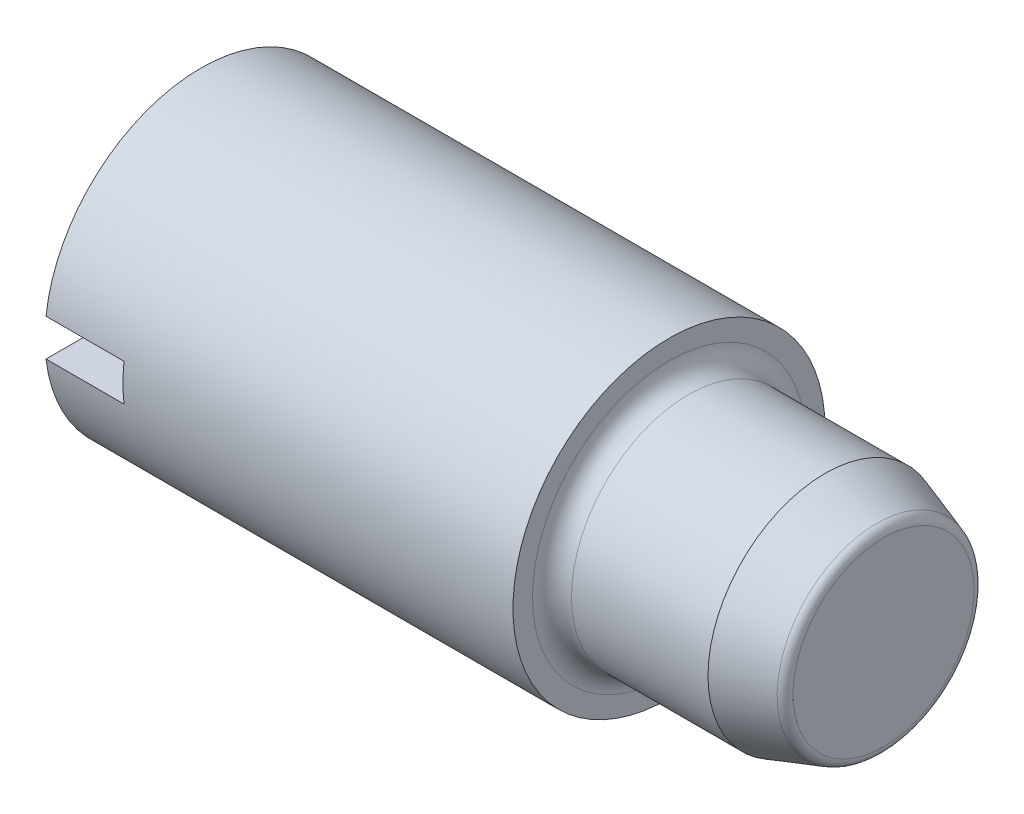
ISO-10303-21;
HEADER;
FILE_DESCRIPTION(('STEP AP214'),'2;1');
FILE_NAME('part.step','',(''),(''),'','','');
FILE_SCHEMA(('AUTOMOTIVE_DESIGN { 1 0 10303 214 1 1 1 1 }'));
ENDSEC;
DATA;
#1=APPLICATION_CONTEXT('core data for automotive mechanical design processes');
#2=APPLICATION_PROTOCOL_DEFINITION('international standard','automotive_design',2000,#1);
#3=PRODUCT_CONTEXT('',#1,'mechanical');
#4=PRODUCT('Part','Part','',(#3));
#5=PRODUCT_RELATED_PRODUCT_CATEGORY('part','',(#4));
#6=PRODUCT_DEFINITION_FORMATION('','',#4);
#7=PRODUCT_DEFINITION_CONTEXT('part definition',#1,'design');
#8=PRODUCT_DEFINITION('design','',#6,#7);
#9=PRODUCT_DEFINITION_SHAPE('','',#8);
#10=(LENGTH_UNIT() NAMED_UNIT(*) SI_UNIT(.MILLI.,.METRE.));
#11=(NAMED_UNIT(*) PLANE_ANGLE_UNIT() SI_UNIT($,.RADIAN.));
#12=(NAMED_UNIT(*) SI_UNIT($,.STERADIAN.) SOLID_ANGLE_UNIT());
#13=UNCERTAINTY_MEASURE_WITH_UNIT(LENGTH_MEASURE(1.E-05),#10,'distance_accuracy_value','');
#14=(GEOMETRIC_REPRESENTATION_CONTEXT(3) GLOBAL_UNCERTAINTY_ASSIGNED_CONTEXT((#13)) GLOBAL_UNIT_ASSIGNED_CONTEXT((#10,
#11,#12)) REPRESENTATION_CONTEXT('',''));
#15=CARTESIAN_POINT('',(0.,0.,0.));
#16=DIRECTION('',(0.,0.,1.));
#17=DIRECTION('',(1.,0.,0.));
#18=AXIS2_PLACEMENT_3D('',#15,#16,#17);
#19=CARTESIAN_POINT('',(29.7338498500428,3.,0.));
#20=DIRECTION('',(1.,0.,0.));
#21=DIRECTION('',(0.,0.,-1.));
#22=AXIS2_PLACEMENT_3D('',#19,#20,#21);
#23=PLANE('',#22);
#24=CARTESIAN_POINT('',(29.7338498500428,0.,0.));
#25=DIRECTION('',(-1.,0.,0.));
#26=DIRECTION('',(0.,1.,0.));
#27=AXIS2_PLACEMENT_3D('',#24,#25,#26);
#28=CIRCLE('',#27,4.63962038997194);
#29=CARTESIAN_POINT('',(29.7338498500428,4.63962038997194,0.));
#30=VERTEX_POINT('',#29);
#31=EDGE_CURVE('E88',#30,#30,#28,.T.);
#32=ORIENTED_EDGE('',*,*,#31,.F.);
#33=EDGE_LOOP('',(#32));
#34=FACE_BOUND('',#33,.T.);
#35=ADVANCED_FACE('F16',(#34),#23,.T.);
#36=CARTESIAN_POINT('',(29.2338498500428,0.,0.));
#37=DIRECTION('',(-1.,0.,0.));
#38=DIRECTION('',(0.,0.,1.));
#39=AXIS2_PLACEMENT_3D('',#36,#37,#38);
#40=TOROIDAL_SURFACE('',#39,4.63962038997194,0.5);
#41=CARTESIAN_POINT('',(29.3919637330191,0.,0.));
#42=DIRECTION('',(-1.,0.,0.));
#43=DIRECTION('',(0.,-1.,0.));
#44=AXIS2_PLACEMENT_3D('',#41,#42,#43);
#45=CIRCLE('',#44,5.11396203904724);
#46=CARTESIAN_POINT('',(29.3919637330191,-5.11396203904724,0.));
#47=VERTEX_POINT('',#46);
#48=EDGE_CURVE('E114',#47,#47,#45,.T.);
#49=ORIENTED_EDGE('',*,*,#48,.F.);
#50=EDGE_LOOP('',(#49));
#51=FACE_BOUND('',#50,.T.);
#52=ORIENTED_EDGE('',*,*,#31,.T.);
#53=EDGE_LOOP('',(#52));
#54=FACE_BOUND('',#53,.T.);
#55=ADVANCED_FACE('F93',(#51,#54),#40,.T.);
#56=CARTESIAN_POINT('',(26.733849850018,0.,0.));
#57=DIRECTION('',(-1.,0.,0.));
#58=DIRECTION('',(0.,0.,1.));
#59=AXIS2_PLACEMENT_3D('',#56,#57,#58);
#60=CONICAL_SURFACE('',#59,6.00000000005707,0.32175055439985);
#61=ORIENTED_EDGE('',*,*,#48,.T.);
#62=EDGE_LOOP('',(#61));
#63=FACE_BOUND('',#62,.T.);
#64=CARTESIAN_POINT('',(26.7338498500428,0.,0.));
#65=DIRECTION('',(1.,0.,0.));
#66=DIRECTION('',(0.,0.,-1.));
#67=AXIS2_PLACEMENT_3D('',#64,#65,#66);
#68=CIRCLE('',#67,6.);
#69=CARTESIAN_POINT('',(26.7338498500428,0.,-6.));
#70=VERTEX_POINT('',#69);
#71=EDGE_CURVE('E117',#70,#70,#68,.F.);
#72=ORIENTED_EDGE('',*,*,#71,.F.);
#73=EDGE_LOOP('',(#72));
#74=FACE_BOUND('',#73,.T.);
#75=ADVANCED_FACE('F104',(#63,#74),#60,.T.);
#76=CARTESIAN_POINT('',(24.2338498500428,0.,0.));
#77=DIRECTION('',(1.,0.,0.));
#78=DIRECTION('',(0.,0.,-1.));
#79=AXIS2_PLACEMENT_3D('',#76,#77,#78);
#80=CYLINDRICAL_SURFACE('',#79,6.);
#81=CARTESIAN_POINT('',(19.7338498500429,0.,0.));
#82=DIRECTION('',(1.,0.,0.));
#83=DIRECTION('',(0.,0.,-1.));
#84=AXIS2_PLACEMENT_3D('',#81,#82,#83);
#85=CIRCLE('',#84,6.);
#86=CARTESIAN_POINT('',(19.7338498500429,0.,-6.));
#87=VERTEX_POINT('',#86);
#88=EDGE_CURVE('E120',#87,#87,#85,.F.);
#89=ORIENTED_EDGE('',*,*,#88,.F.);
#90=EDGE_LOOP('',(#89));
#91=FACE_BOUND('',#90,.T.);
#92=ORIENTED_EDGE('',*,*,#71,.T.);
#93=EDGE_LOOP('',(#92));
#94=FACE_BOUND('',#93,.T.);
#95=ADVANCED_FACE('F129',(#91,#94),#80,.T.);
#96=CARTESIAN_POINT('',(19.7338498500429,0.,0.));
#97=DIRECTION('',(1.,0.,0.));
#98=DIRECTION('',(0.,0.,-1.));
#99=AXIS2_PLACEMENT_3D('',#96,#97,#98);
#100=TOROIDAL_SURFACE('',#99,7.,1.);
#101=ORIENTED_EDGE('',*,*,#88,.T.);
#102=EDGE_LOOP('',(#101));
#103=FACE_BOUND('',#102,.T.);
#104=CARTESIAN_POINT('',(18.7338498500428,0.,0.));
#105=DIRECTION('',(1.,0.,0.));
#106=DIRECTION('',(0.,1.,0.));
#107=AXIS2_PLACEMENT_3D('',#104,#105,#106);
#108=CIRCLE('',#107,7.);
#109=CARTESIAN_POINT('',(18.7338498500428,7.,0.));
#110=VERTEX_POINT('',#109);
#111=EDGE_CURVE('E75',#110,#110,#108,.F.);
#112=ORIENTED_EDGE('',*,*,#111,.F.);
#113=EDGE_LOOP('',(#112));
#114=FACE_BOUND('',#113,.T.);
#115=ADVANCED_FACE('F124',(#103,#114),#100,.F.);
#116=CARTESIAN_POINT('',(-5.26615014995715,4.,0.));
#117=DIRECTION('',(-1.,0.,0.));
#118=DIRECTION('',(0.,0.,1.));
#119=AXIS2_PLACEMENT_3D('',#116,#117,#118);
#120=PLANE('',#119);
#121=CARTESIAN_POINT('',(-5.26615014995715,0.,0.));
#122=DIRECTION('',(1.,0.,0.));
#123=DIRECTION('',(0.,0.,-1.));
#124=AXIS2_PLACEMENT_3D('',#121,#122,#123);
#125=CIRCLE('',#124,8.);
#126=CARTESIAN_POINT('',(-5.26615014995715,0.949999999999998,-7.9433934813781));
#127=VERTEX_POINT('',#126);
#128=CARTESIAN_POINT('',(-5.26615014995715,0.949999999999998,7.9433934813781));
#129=VERTEX_POINT('',#128);
#130=EDGE_CURVE('E147',#127,#129,#125,.T.);
#131=ORIENTED_EDGE('',*,*,#130,.F.);
#132=DIRECTION('',(0.,0.,1.));
#133=VECTOR('',#132,1.);
#134=CARTESIAN_POINT('',(-5.26615014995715,0.949999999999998,9.));
#135=LINE('',#134,#133);
#136=EDGE_CURVE('E67',#127,#129,#135,.T.);
#137=ORIENTED_EDGE('',*,*,#136,.T.);
#138=EDGE_LOOP('',(#131,#137));
#139=FACE_BOUND('',#138,.T.);
#140=ADVANCED_FACE('F128',(#139),#120,.T.);
#141=CARTESIAN_POINT('',(-5.26615014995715,0.949999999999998,9.));
#142=DIRECTION('',(0.,1.,0.));
#143=DIRECTION('',(0.,0.,1.));
#144=AXIS2_PLACEMENT_3D('',#141,#142,#143);
#145=PLANE('',#144);
#146=ORIENTED_EDGE('',*,*,#136,.F.);
#147=DIRECTION('',(1.,0.,0.));
#148=VECTOR('',#147,1.);
#149=CARTESIAN_POINT('',(6.73384985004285,0.949999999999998,-7.9433934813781));
#150=LINE('',#149,#148);
#151=CARTESIAN_POINT('',(-1.26615014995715,0.949999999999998,-7.9433934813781));
#152=VERTEX_POINT('',#151);
#153=EDGE_CURVE('E71',#152,#127,#150,.F.);
#154=ORIENTED_EDGE('',*,*,#153,.F.);
#155=DIRECTION('',(0.,0.,-1.));
#156=VECTOR('',#155,1.);
#157=CARTESIAN_POINT('',(-1.26615014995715,0.949999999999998,0.));
#158=LINE('',#157,#156);
#159=CARTESIAN_POINT('',(-1.26615014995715,0.949999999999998,7.9433934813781));
#160=VERTEX_POINT('',#159);
#161=EDGE_CURVE('E56',#152,#160,#158,.F.);
#162=ORIENTED_EDGE('',*,*,#161,.T.);
#163=DIRECTION('',(1.,0.,0.));
#164=VECTOR('',#163,1.);
#165=CARTESIAN_POINT('',(6.73384985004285,0.949999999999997,7.9433934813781));
#166=LINE('',#165,#164);
#167=EDGE_CURVE('E145',#129,#160,#166,.T.);
#168=ORIENTED_EDGE('',*,*,#167,.F.);
#169=EDGE_LOOP('',(#146,#154,#162,#168));
#170=FACE_BOUND('',#169,.T.);
#171=ADVANCED_FACE('F72',(#170),#145,.F.);
#172=CARTESIAN_POINT('',(-1.26615014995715,0.,0.));
#173=DIRECTION('',(1.,0.,0.));
#174=DIRECTION('',(0.,0.,-1.));
#175=AXIS2_PLACEMENT_3D('',#172,#173,#174);
#176=PLANE('',#175);
#177=ORIENTED_EDGE('',*,*,#161,.F.);
#178=CARTESIAN_POINT('',(-1.26615014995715,0.,0.));
#179=DIRECTION('',(1.,0.,0.));
#180=DIRECTION('',(0.,0.,-1.));
#181=AXIS2_PLACEMENT_3D('',#178,#179,#180);
#182=CIRCLE('',#181,8.);
#183=CARTESIAN_POINT('',(-1.26615014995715,-0.950000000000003,-7.9433934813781));
#184=VERTEX_POINT('',#183);
#185=EDGE_CURVE('E20',#184,#152,#182,.T.);
#186=ORIENTED_EDGE('',*,*,#185,.F.);
#187=DIRECTION('',(0.,0.,-1.));
#188=VECTOR('',#187,1.);
#189=CARTESIAN_POINT('',(-1.26615014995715,-0.950000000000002,-9.));
#190=LINE('',#189,#188);
#191=CARTESIAN_POINT('',(-1.26615014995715,-0.949999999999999,7.9433934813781));
#192=VERTEX_POINT('',#191);
#193=EDGE_CURVE('E66',#184,#192,#190,.F.);
#194=ORIENTED_EDGE('',*,*,#193,.T.);
#195=CARTESIAN_POINT('',(-1.26615014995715,0.,0.));
#196=DIRECTION('',(1.,0.,0.));
#197=DIRECTION('',(0.,0.,-1.));
#198=AXIS2_PLACEMENT_3D('',#195,#196,#197);
#199=CIRCLE('',#198,8.);
#200=EDGE_CURVE('E62',#160,#192,#199,.T.);
#201=ORIENTED_EDGE('',*,*,#200,.F.);
#202=EDGE_LOOP('',(#177,#186,#194,#201));
#203=FACE_BOUND('',#202,.T.);
#204=ADVANCED_FACE('F58',(#203),#176,.F.);
#205=CARTESIAN_POINT('',(-5.26615014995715,-0.950000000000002,-9.));
#206=DIRECTION('',(0.,-1.,0.));
#207=DIRECTION('',(0.,0.,-1.));
#208=AXIS2_PLACEMENT_3D('',#205,#206,#207);
#209=PLANE('',#208);
#210=ORIENTED_EDGE('',*,*,#193,.F.);
#211=DIRECTION('',(1.,0.,0.));
#212=VECTOR('',#211,1.);
#213=CARTESIAN_POINT('',(6.73384985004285,-0.950000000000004,-7.9433934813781));
#214=LINE('',#213,#212);
#215=CARTESIAN_POINT('',(-5.26615014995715,-0.950000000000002,-7.9433934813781));
#216=VERTEX_POINT('',#215);
#217=EDGE_CURVE('E79',#216,#184,#214,.T.);
#218=ORIENTED_EDGE('',*,*,#217,.F.);
#219=DIRECTION('',(0.,0.,1.));
#220=VECTOR('',#219,1.);
#221=CARTESIAN_POINT('',(-5.26615014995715,-0.95,0.));
#222=LINE('',#221,#220);
#223=CARTESIAN_POINT('',(-5.26615014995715,-0.95,7.9433934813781));
#224=VERTEX_POINT('',#223);
#225=EDGE_CURVE('E35',#224,#216,#222,.F.);
#226=ORIENTED_EDGE('',*,*,#225,.F.);
#227=DIRECTION('',(1.,0.,0.));
#228=VECTOR('',#227,1.);
#229=CARTESIAN_POINT('',(6.73384985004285,-0.949999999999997,7.9433934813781));
#230=LINE('',#229,#228);
#231=EDGE_CURVE('E149',#192,#224,#230,.F.);
#232=ORIENTED_EDGE('',*,*,#231,.F.);
#233=EDGE_LOOP('',(#210,#218,#226,#232));
#234=FACE_BOUND('',#233,.T.);
#235=ADVANCED_FACE('F168',(#234),#209,.F.);
#236=CARTESIAN_POINT('',(-5.26615014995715,4.,0.));
#237=DIRECTION('',(-1.,0.,0.));
#238=DIRECTION('',(0.,0.,1.));
#239=AXIS2_PLACEMENT_3D('',#236,#237,#238);
#240=PLANE('',#239);
#241=ORIENTED_EDGE('',*,*,#225,.T.);
#242=CARTESIAN_POINT('',(-5.26615014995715,0.,0.));
#243=DIRECTION('',(1.,0.,0.));
#244=DIRECTION('',(0.,0.,-1.));
#245=AXIS2_PLACEMENT_3D('',#242,#243,#244);
#246=CIRCLE('',#245,8.);
#247=EDGE_CURVE('E26',#224,#216,#246,.T.);
#248=ORIENTED_EDGE('',*,*,#247,.F.);
#249=EDGE_LOOP('',(#241,#248));
#250=FACE_BOUND('',#249,.T.);
#251=ADVANCED_FACE('F164',(#250),#240,.T.);
#252=CARTESIAN_POINT('',(18.7338498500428,7.,0.));
#253=DIRECTION('',(1.,0.,0.));
#254=DIRECTION('',(0.,0.,-1.));
#255=AXIS2_PLACEMENT_3D('',#252,#253,#254);
#256=PLANE('',#255);
#257=ORIENTED_EDGE('',*,*,#111,.T.);
#258=EDGE_LOOP('',(#257));
#259=FACE_BOUND('',#258,.T.);
#260=CARTESIAN_POINT('',(18.7338498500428,0.,0.));
#261=DIRECTION('',(1.,0.,0.));
#262=DIRECTION('',(0.,0.,-1.));
#263=AXIS2_PLACEMENT_3D('',#260,#261,#262);
#264=CIRCLE('',#263,8.);
#265=CARTESIAN_POINT('',(18.7338498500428,0.,-8.));
#266=VERTEX_POINT('',#265);
#267=EDGE_CURVE('E10',#266,#266,#264,.F.);
#268=ORIENTED_EDGE('',*,*,#267,.F.);
#269=EDGE_LOOP('',(#268));
#270=FACE_BOUND('',#269,.T.);
#271=ADVANCED_FACE('F155',(#259,#270),#256,.T.);
#272=CARTESIAN_POINT('',(6.73384985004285,0.,0.));
#273=DIRECTION('',(1.,0.,0.));
#274=DIRECTION('',(0.,0.,-1.));
#275=AXIS2_PLACEMENT_3D('',#272,#273,#274);
#276=CYLINDRICAL_SURFACE('',#275,8.);
#277=ORIENTED_EDGE('',*,*,#153,.T.);
#278=ORIENTED_EDGE('',*,*,#130,.T.);
#279=ORIENTED_EDGE('',*,*,#167,.T.);
#280=ORIENTED_EDGE('',*,*,#200,.T.);
#281=ORIENTED_EDGE('',*,*,#231,.T.);
#282=ORIENTED_EDGE('',*,*,#247,.T.);
#283=ORIENTED_EDGE('',*,*,#217,.T.);
#284=ORIENTED_EDGE('',*,*,#185,.T.);
#285=EDGE_LOOP('',(#277,#278,#279,#280,#281,#282,#283,#284));
#286=FACE_BOUND('',#285,.T.);
#287=ORIENTED_EDGE('',*,*,#267,.T.);
#288=EDGE_LOOP('',(#287));
#289=FACE_BOUND('',#288,.T.);
#290=ADVANCED_FACE('F18',(#286,#289),#276,.T.);
#291=CLOSED_SHELL('',(#35,#55,#75,#95,#115,#140,#171,#204,#235,#251,#271,#290));
#292=MANIFOLD_SOLID_BREP('B1',#291);
#293=ADVANCED_BREP_SHAPE_REPRESENTATION('',(#18,#292),#14);
#294=SHAPE_DEFINITION_REPRESENTATION(#9,#293);
ENDSEC;
END-ISO-10303-21;
